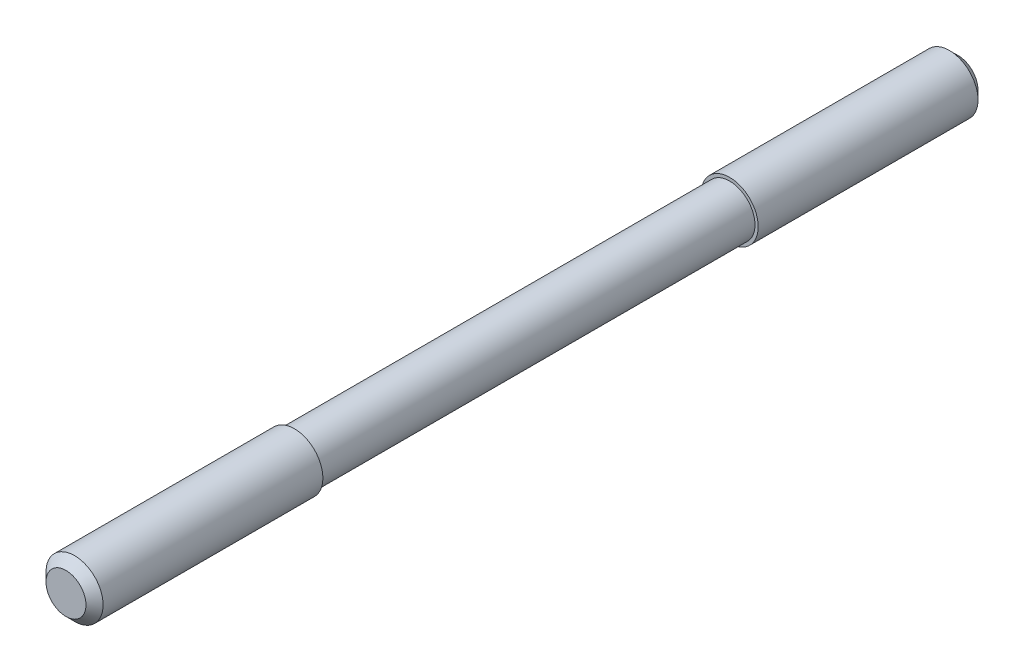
ISO-10303-21;
HEADER;
FILE_DESCRIPTION(('STEP AP214'),'2;1');
FILE_NAME('part.step','',(''),(''),'','','');
FILE_SCHEMA(('AUTOMOTIVE_DESIGN { 1 0 10303 214 1 1 1 1 }'));
ENDSEC;
DATA;
#1=APPLICATION_CONTEXT('core data for automotive mechanical design processes');
#2=APPLICATION_PROTOCOL_DEFINITION('international standard','automotive_design',2000,#1);
#3=PRODUCT_CONTEXT('',#1,'mechanical');
#4=PRODUCT('Part','Part','',(#3));
#5=PRODUCT_RELATED_PRODUCT_CATEGORY('part','',(#4));
#6=PRODUCT_DEFINITION_FORMATION('','',#4);
#7=PRODUCT_DEFINITION_CONTEXT('part definition',#1,'design');
#8=PRODUCT_DEFINITION('design','',#6,#7);
#9=PRODUCT_DEFINITION_SHAPE('','',#8);
#10=(LENGTH_UNIT() NAMED_UNIT(*) SI_UNIT(.MILLI.,.METRE.));
#11=(NAMED_UNIT(*) PLANE_ANGLE_UNIT() SI_UNIT($,.RADIAN.));
#12=(NAMED_UNIT(*) SI_UNIT($,.STERADIAN.) SOLID_ANGLE_UNIT());
#13=UNCERTAINTY_MEASURE_WITH_UNIT(LENGTH_MEASURE(1.E-05),#10,'distance_accuracy_value','');
#14=(GEOMETRIC_REPRESENTATION_CONTEXT(3) GLOBAL_UNCERTAINTY_ASSIGNED_CONTEXT((#13)) GLOBAL_UNIT_ASSIGNED_CONTEXT((#10,
#11,#12)) REPRESENTATION_CONTEXT('',''));
#15=CARTESIAN_POINT('',(0.,0.,0.));
#16=DIRECTION('',(0.,0.,1.));
#17=DIRECTION('',(1.,0.,0.));
#18=AXIS2_PLACEMENT_3D('',#15,#16,#17);
#19=CARTESIAN_POINT('',(0.,0.,0.));
#20=DIRECTION('',(0.,0.,1.));
#21=DIRECTION('',(1.,0.,0.));
#22=AXIS2_PLACEMENT_3D('',#19,#20,#21);
#23=PLANE('',#22);
#24=CARTESIAN_POINT('',(0.,0.,0.));
#25=DIRECTION('',(0.,0.,1.));
#26=DIRECTION('',(1.,0.,0.));
#27=AXIS2_PLACEMENT_3D('',#24,#25,#26);
#28=CIRCLE('',#27,2.8);
#29=CARTESIAN_POINT('',(2.8,0.,0.));
#30=VERTEX_POINT('',#29);
#31=EDGE_CURVE('E8',#30,#30,#28,.T.);
#32=ORIENTED_EDGE('',*,*,#31,.F.);
#33=EDGE_LOOP('',(#32));
#34=FACE_BOUND('',#33,.T.);
#35=ADVANCED_FACE('F12',(#34),#23,.F.);
#36=CARTESIAN_POINT('',(0.,0.,1.2));
#37=DIRECTION('',(0.,0.,1.));
#38=DIRECTION('',(1.,0.,0.));
#39=AXIS2_PLACEMENT_3D('',#36,#37,#38);
#40=CONICAL_SURFACE('',#39,4.,0.785398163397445);
#41=ORIENTED_EDGE('',*,*,#31,.T.);
#42=EDGE_LOOP('',(#41));
#43=FACE_BOUND('',#42,.T.);
#44=CARTESIAN_POINT('',(0.,0.,1.2));
#45=DIRECTION('',(0.,0.,1.));
#46=DIRECTION('',(1.,0.,0.));
#47=AXIS2_PLACEMENT_3D('',#44,#45,#46);
#48=CIRCLE('',#47,4.);
#49=CARTESIAN_POINT('',(4.,0.,1.2));
#50=VERTEX_POINT('',#49);
#51=EDGE_CURVE('E18',#50,#50,#48,.T.);
#52=ORIENTED_EDGE('',*,*,#51,.F.);
#53=EDGE_LOOP('',(#52));
#54=FACE_BOUND('',#53,.T.);
#55=ADVANCED_FACE('F61',(#43,#54),#40,.T.);
#56=CARTESIAN_POINT('',(0.,0.,70.));
#57=DIRECTION('',(0.,0.,1.));
#58=DIRECTION('',(1.,0.,0.));
#59=AXIS2_PLACEMENT_3D('',#56,#57,#58);
#60=CYLINDRICAL_SURFACE('',#59,4.);
#61=CARTESIAN_POINT('',(0.,0.,32.));
#62=DIRECTION('',(0.,0.,1.));
#63=DIRECTION('',(1.,0.,0.));
#64=AXIS2_PLACEMENT_3D('',#61,#62,#63);
#65=CIRCLE('',#64,4.);
#66=CARTESIAN_POINT('',(4.,0.,32.));
#67=VERTEX_POINT('',#66);
#68=EDGE_CURVE('E22',#67,#67,#65,.T.);
#69=ORIENTED_EDGE('',*,*,#68,.F.);
#70=EDGE_LOOP('',(#69));
#71=FACE_BOUND('',#70,.T.);
#72=ORIENTED_EDGE('',*,*,#51,.T.);
#73=EDGE_LOOP('',(#72));
#74=FACE_BOUND('',#73,.T.);
#75=ADVANCED_FACE('F66',(#71,#74),#60,.T.);
#76=CARTESIAN_POINT('',(4.,0.,32.));
#77=DIRECTION('',(0.,0.,-1.));
#78=DIRECTION('',(-1.,0.,0.));
#79=AXIS2_PLACEMENT_3D('',#76,#77,#78);
#80=PLANE('',#79);
#81=CARTESIAN_POINT('',(0.,0.,32.));
#82=DIRECTION('',(0.,0.,1.));
#83=DIRECTION('',(1.,0.,0.));
#84=AXIS2_PLACEMENT_3D('',#81,#82,#83);
#85=CIRCLE('',#84,3.55);
#86=CARTESIAN_POINT('',(3.55,0.,32.));
#87=VERTEX_POINT('',#86);
#88=EDGE_CURVE('E26',#87,#87,#85,.T.);
#89=ORIENTED_EDGE('',*,*,#88,.F.);
#90=EDGE_LOOP('',(#89));
#91=FACE_BOUND('',#90,.T.);
#92=ORIENTED_EDGE('',*,*,#68,.T.);
#93=EDGE_LOOP('',(#92));
#94=FACE_BOUND('',#93,.T.);
#95=ADVANCED_FACE('F70',(#91,#94),#80,.F.);
#96=CARTESIAN_POINT('',(0.,0.,70.));
#97=DIRECTION('',(0.,0.,1.));
#98=DIRECTION('',(1.,0.,0.));
#99=AXIS2_PLACEMENT_3D('',#96,#97,#98);
#100=CYLINDRICAL_SURFACE('',#99,3.55);
#101=CARTESIAN_POINT('',(0.,0.,93.));
#102=DIRECTION('',(0.,0.,1.));
#103=DIRECTION('',(1.,0.,0.));
#104=AXIS2_PLACEMENT_3D('',#101,#102,#103);
#105=CIRCLE('',#104,3.55);
#106=CARTESIAN_POINT('',(3.55,0.,93.));
#107=VERTEX_POINT('',#106);
#108=EDGE_CURVE('E31',#107,#107,#105,.T.);
#109=ORIENTED_EDGE('',*,*,#108,.F.);
#110=EDGE_LOOP('',(#109));
#111=FACE_BOUND('',#110,.T.);
#112=ORIENTED_EDGE('',*,*,#88,.T.);
#113=EDGE_LOOP('',(#112));
#114=FACE_BOUND('',#113,.T.);
#115=ADVANCED_FACE('F77',(#111,#114),#100,.T.);
#116=CARTESIAN_POINT('',(3.55,0.,93.));
#117=DIRECTION('',(0.,0.,1.));
#118=DIRECTION('',(1.,0.,0.));
#119=AXIS2_PLACEMENT_3D('',#116,#117,#118);
#120=PLANE('',#119);
#121=CARTESIAN_POINT('',(0.,0.,93.));
#122=DIRECTION('',(0.,0.,1.));
#123=DIRECTION('',(1.,0.,0.));
#124=AXIS2_PLACEMENT_3D('',#121,#122,#123);
#125=CIRCLE('',#124,4.);
#126=CARTESIAN_POINT('',(4.,0.,93.));
#127=VERTEX_POINT('',#126);
#128=EDGE_CURVE('E34',#127,#127,#125,.T.);
#129=ORIENTED_EDGE('',*,*,#128,.F.);
#130=EDGE_LOOP('',(#129));
#131=FACE_BOUND('',#130,.T.);
#132=ORIENTED_EDGE('',*,*,#108,.T.);
#133=EDGE_LOOP('',(#132));
#134=FACE_BOUND('',#133,.T.);
#135=ADVANCED_FACE('F57',(#131,#134),#120,.F.);
#136=CARTESIAN_POINT('',(0.,0.,70.));
#137=DIRECTION('',(0.,0.,1.));
#138=DIRECTION('',(1.,0.,0.));
#139=AXIS2_PLACEMENT_3D('',#136,#137,#138);
#140=CYLINDRICAL_SURFACE('',#139,4.);
#141=CARTESIAN_POINT('',(0.,0.,123.8));
#142=DIRECTION('',(0.,0.,1.));
#143=DIRECTION('',(1.,0.,0.));
#144=AXIS2_PLACEMENT_3D('',#141,#142,#143);
#145=CIRCLE('',#144,4.);
#146=CARTESIAN_POINT('',(4.,0.,123.8));
#147=VERTEX_POINT('',#146);
#148=EDGE_CURVE('E37',#147,#147,#145,.T.);
#149=ORIENTED_EDGE('',*,*,#148,.F.);
#150=EDGE_LOOP('',(#149));
#151=FACE_BOUND('',#150,.T.);
#152=ORIENTED_EDGE('',*,*,#128,.T.);
#153=EDGE_LOOP('',(#152));
#154=FACE_BOUND('',#153,.T.);
#155=ADVANCED_FACE('F48',(#151,#154),#140,.T.);
#156=CARTESIAN_POINT('',(0.,0.,125.));
#157=DIRECTION('',(0.,0.,-1.));
#158=DIRECTION('',(-1.,0.,0.));
#159=AXIS2_PLACEMENT_3D('',#156,#157,#158);
#160=CONICAL_SURFACE('',#159,2.8,0.785398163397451);
#161=ORIENTED_EDGE('',*,*,#148,.T.);
#162=EDGE_LOOP('',(#161));
#163=FACE_BOUND('',#162,.T.);
#164=CARTESIAN_POINT('',(0.,0.,125.));
#165=DIRECTION('',(0.,0.,1.));
#166=DIRECTION('',(1.,0.,0.));
#167=AXIS2_PLACEMENT_3D('',#164,#165,#166);
#168=CIRCLE('',#167,2.8);
#169=CARTESIAN_POINT('',(2.8,0.,125.));
#170=VERTEX_POINT('',#169);
#171=EDGE_CURVE('E40',#170,#170,#168,.T.);
#172=ORIENTED_EDGE('',*,*,#171,.F.);
#173=EDGE_LOOP('',(#172));
#174=FACE_BOUND('',#173,.T.);
#175=ADVANCED_FACE('F46',(#163,#174),#160,.T.);
#176=CARTESIAN_POINT('',(2.8,0.,125.));
#177=DIRECTION('',(0.,0.,-1.));
#178=DIRECTION('',(-1.,0.,0.));
#179=AXIS2_PLACEMENT_3D('',#176,#177,#178);
#180=PLANE('',#179);
#181=ORIENTED_EDGE('',*,*,#171,.T.);
#182=EDGE_LOOP('',(#181));
#183=FACE_BOUND('',#182,.T.);
#184=ADVANCED_FACE('F44',(#183),#180,.F.);
#185=CLOSED_SHELL('',(#35,#55,#75,#95,#115,#135,#155,#175,#184));
#186=MANIFOLD_SOLID_BREP('B1',#185);
#187=ADVANCED_BREP_SHAPE_REPRESENTATION('',(#18,#186),#14);
#188=SHAPE_DEFINITION_REPRESENTATION(#9,#187);
ENDSEC;
END-ISO-10303-21;
